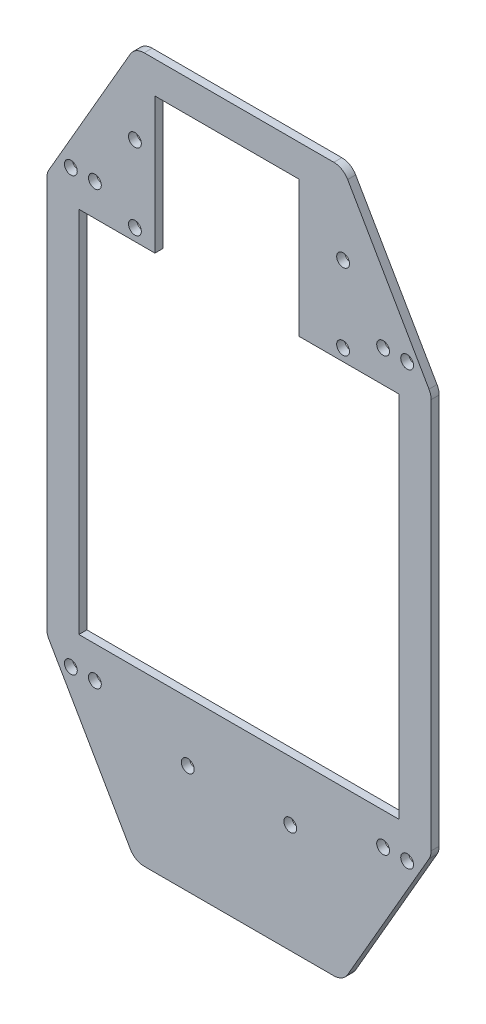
from build123d import *

# Parameters (mm, degrees)
EXTRUDE_1_DEPTH           = 30
EXTRUDE_2_DEPTH           = 40
MIRROR_2_COPY_1_DEPTH     = 40
EXTRUDE_START             = 20
SKETCH_3_W                = 200
SKETCH_3_H                = 230
EXTRUDE_3_DEPTH           = 20
EXTRUDE_START_2           = -10
EXTRUDE_11_DEPTH          = 15
FILLET_3_R                = 5
SKETCH_6_W                = 22
SKETCH_6_H                = 22
EXTRUDE_12_DEPTH          = 225
M8X1_0_1_AT_2_COUNT       = 2
M8X1_0_1_AT_2_PITCH       = 47.5
SKETCH_14_W               = 75
SKETCH_14_H               = 1
CUT_EXTRUDE_1_DEPTH       = 10
EXTRUDE_START_3           = -21
EXTRUDE_13_DEPTH          = 20
CUT_EXTRUDE_3_DEPTH       = 20
FILLET_4_R                = 5
EXTRUDE_14_REACH          = 388.297
EXTRUDE_START_4           = 5
SKETCH_20_W               = 200
SKETCH_20_H               = 230
EXTRUDE_15_DEPTH          = 5
SKETCH_24_W               = 75
SKETCH_24_H               = 85
EXTRUDE_16_DEPTH          = 30
HOLE_WIZARD_M8_1_D        = 6.8
HOLE_WIZARD_M8_1_DEPTH    = 20
HOLE_WIZARD_M8_1_TIP      = 2.042926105
EXTRUDE_START_5           = -12
EXTRUDE_17_DEPTH          = 5
PATTERN_LINEAR_2_COUNT    = 2
PATTERN_LINEAR_2_PITCH    = 26
HOLE_WIZARD_M8_2_D        = 6.8
HOLE_WIZARD_M8_2_DEPTH    = 22.5
HOLE_WIZARD_M8_2_TIP      = 2.042926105
SKETCH_32_W               = 15
SKETCH_32_H               = 85
CUT_EXTRUDE_7_DEPTH       = 30
SKETCH_33_W               = 90
SKETCH_33_H               = 85
CUT_EXTRUDE_8_DEPTH       = 12
SKETCH_34_W               = 100
SKETCH_34_H               = 59
CUT_EXTRUDE_9_DEPTH       = 9.25
SKETCH_35_W               = 350.252733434
SKETCH_35_H               = 581.551708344
CUT_EXTRUDE_10_DEPTH      = 21
CUT_EXTRUDE_START         = -5
SKETCH_53_W               = 746.993473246
SKETCH_53_H               = 735.961924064
CUT_EXTRUDE_26_DEPTH      = 110
SKETCH_54_OUTSIDE_W       = 605.222
SKETCH_54_OUTSIDE_H       = 775.222
CUT_EXTRUDE_27_DEPTH      = 110
SKETCH_57_R               = 4
CUT_EXTRUDE_28_DEPTH      = 10
SKETCH_59_R               = 4
CUT_EXTRUDE_29_DEPTH      = 10
MIRROR_11_COPY_1_SKETCH_R = 4
MIRROR_11_COPY_1_DEPTH    = 10


with BuildPart() as part:
    # Sketch 1 → Extrude 1 (new body)
    with BuildSketch(Plane.XY):
        with BuildLine():
            Line((-118.660254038, 127.025650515), (-67.868239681, 215))
            ThreePointArc((-67.868239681, 215), (-64.207985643, 218.660254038), (-59.207985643, 220))
            Line((-59.207985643, 220), (59.207985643, 220))
            ThreePointArc((59.207985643, 220), (64.207985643, 218.660254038), (67.868239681, 215))
            Line((67.868239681, 215), (118.660254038, 127.025650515))
            ThreePointArc((118.660254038, 127.025650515), (119.659258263, 124.613840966), (120, 122.025650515))
            Line((120, 122.025650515), (120, -122.025650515))
            ThreePointArc((120, -122.025650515), (119.659258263, -124.613840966), (118.660254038, -127.025650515))
            Line((118.660254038, -127.025650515), (67.868239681, -215))
            ThreePointArc((67.868239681, -215), (64.207985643, -218.660254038), (59.207985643, -220))
            Line((59.207985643, -220), (-59.207985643, -220))
            ThreePointArc((-59.207985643, -220), (-64.207985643, -218.660254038), (-67.868239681, -215))
            Line((-67.868239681, -215), (-118.660254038, -127.025650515))
            ThreePointArc((-118.660254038, -127.025650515), (-119.659258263, -124.613840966), (-120, -122.025650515))
            Line((-120, -122.025650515), (-120, 122.025650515))
            ThreePointArc((-120, 122.025650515), (-119.659258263, 124.613840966), (-118.660254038, 127.025650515))
        make_face()
        with BuildLine():
            Line((-98.660254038, 121.666666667), (-56.321234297, 195))
            ThreePointArc((-56.321234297, 195), (-52.660980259, 198.660254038), (-47.660980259, 200))
            Line((-47.660980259, 200), (47.660980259, 200))
            ThreePointArc((47.660980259, 200), (52.660980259, 198.660254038), (56.321234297, 195))
            Line((56.321234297, 195), (98.660254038, 121.666666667))
            ThreePointArc((98.660254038, 121.666666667), (99.659258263, 119.254857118), (100, 116.666666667))
            Line((100, 116.666666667), (100, -116.666666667))
            ThreePointArc((100, -116.666666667), (99.659258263, -119.254857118), (98.660254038, -121.666666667))
            Line((98.660254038, -121.666666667), (56.321234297, -195))
            ThreePointArc((56.321234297, -195), (52.660980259, -198.660254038), (47.660980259, -200))
            Line((47.660980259, -200), (-47.660980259, -200))
            ThreePointArc((-47.660980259, -200), (-52.660980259, -198.660254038), (-56.321234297, -195))
            Line((-56.321234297, -195), (-98.660254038, -121.666666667))
            ThreePointArc((-98.660254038, -121.666666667), (-99.659258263, -119.254857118), (-100, -116.666666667))
            Line((-100, -116.666666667), (-100, 116.666666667))
            ThreePointArc((-100, 116.666666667), (-99.659258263, 119.254857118), (-98.660254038, 121.666666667))
        make_face(mode=Mode.SUBTRACT)
    extrude(amount=EXTRUDE_1_DEPTH)

    # Sketch 2 → Extrude 2 (add)
    with BuildSketch(Plane.XY.offset(30)):
        Polygon((-100, 130), (-70, 130), (-70, 200), (-37.5, 200), (-37.5, 115), (-100, 115), align=None)
    extrude_2 = extrude(amount=-EXTRUDE_2_DEPTH)

    # Mirror 1: Extrude 2 across plane
    add(extrude_2.mirror(Plane.ZX))

    # Mirror 2: Extrude 2 across plane
    add(extrude_2.mirror(Plane(origin=(0, 0, 0), x_dir=(0, 0, 1), z_dir=(1, 0, 0))))

    # Mirror 2 copy 1 sketch → Mirror 2 copy 1 (add)
    with BuildSketch(Plane(origin=(0, 0, 30), x_dir=(-1, 0, 0), z_dir=(0, 0, 1))):
        Polygon((-100, 130), (-70, 130), (-70, 200), (-37.5, 200), (-37.5, 115), (-100, 115), align=None)
    extrude(amount=-MIRROR_2_COPY_1_DEPTH)

    # Sketch 3 → Extrude 3 (add)
    with BuildSketch(Plane(origin=(0, 0, 0), x_dir=(-1, 0, 0), z_dir=(0, 0, -1)).offset(EXTRUDE_START)):
        with BuildLine():
            Line((120, -122.025650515), (120, 122.025650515))
            ThreePointArc((120, 122.025650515), (119.659258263, 124.613840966), (118.660254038, 127.025650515))
            Line((118.660254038, 127.025650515), (67.868239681, 215))
            ThreePointArc((67.868239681, 215), (64.207985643, 218.660254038), (59.207985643, 220))
            Line((59.207985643, 220), (-59.207985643, 220))
            ThreePointArc((-59.207985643, 220), (-64.207985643, 218.660254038), (-67.868239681, 215))
            Line((-67.868239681, 215), (-118.660254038, 127.025650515))
            ThreePointArc((-118.660254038, 127.025650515), (-119.659258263, 124.613840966), (-120, 122.025650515))
            Line((-120, 122.025650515), (-120, -122.025650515))
            ThreePointArc((-120, -122.025650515), (-119.659258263, -124.613840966), (-118.660254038, -127.025650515))
            Line((-118.660254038, -127.025650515), (-67.868239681, -215))
            ThreePointArc((-67.868239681, -215), (-64.207985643, -218.660254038), (-59.207985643, -220))
            Line((-59.207985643, -220), (59.207985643, -220))
            ThreePointArc((59.207985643, -220), (64.207985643, -218.660254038), (67.868239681, -215))
            Line((67.868239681, -215), (118.660254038, -127.025650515))
            ThreePointArc((118.660254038, -127.025650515), (119.659258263, -124.613840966), (120, -122.025650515))
        make_face()
        Rectangle(SKETCH_3_W, SKETCH_3_H, mode=Mode.SUBTRACT)
    extrude(amount=-EXTRUDE_3_DEPTH)

    # Sketch 5 → Extrude 11 (add)
    with BuildSketch(Plane(origin=(0, 0, -20), x_dir=(-1, 0, 0), z_dir=(0, 0, -1)).offset(EXTRUDE_START_2)):
        with BuildLine():
            Line((-67.868239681, 215), (-67.868239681, 310))
            Line((-67.868239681, 310), (67.868239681, 310))
            Line((67.868239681, 310), (67.868239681, 215))
            ThreePointArc((67.868239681, 215), (64.207985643, 218.660254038), (59.207985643, 220))
            Line((59.207985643, 220), (-59.207985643, 220))
            ThreePointArc((-59.207985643, 220), (-64.207985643, 218.660254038), (-67.868239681, 215))
        make_face()
    extrude_11 = extrude(amount=-EXTRUDE_11_DEPTH)

    # Fillet 3
    fillet_3_edges = [part.edges().sort_by_distance(p)[0] for p in [
        (67.868239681, 310, -2.5),
        (-67.868239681, 310, -2.5),
    ]]
    fillet(fillet_3_edges, radius=FILLET_3_R)

    # Sketch 6 → Extrude 12 (add, symmetric)
    with BuildSketch(Plane(origin=(0, 0, 0), x_dir=(0, 0, -1), z_dir=(1, 0, 0))):
        with Locations((6, 210)):
            Rectangle(SKETCH_6_W, SKETCH_6_H)
    extrude_12 = extrude(amount=EXTRUDE_12_DEPTH, both=True)

    # Sketch 11 → M8x1.0 _1 (revolve, cut)
    with BuildSketch(Plane(origin=(-65, 122.5, 30), x_dir=(0, -1, 0), z_dir=(1, 0, 0))):
        Polygon((0, 0), (0, 23.103012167), (3.5, 21), (3.5, 0), align=None)
    m8x1_0_1 = revolve(axis=Axis((-65, 122.5, 36.35), (0, 0, -1)), mode=Mode.SUBTRACT)

    # M8x1.0 _1 at 2: M8x1.0 _1 ×2
    with Locations(*[(0, i * M8X1_0_1_AT_2_PITCH, 0) for i in range(1, M8X1_0_1_AT_2_COUNT)]):
        add(m8x1_0_1, mode=Mode.SUBTRACT)

    # Mirror 7: M8x1.0 _1 across plane
    add(m8x1_0_1.mirror(Plane(origin=(0, 0, 0), x_dir=(0, 0, 1), z_dir=(1, 0, 0))), mode=Mode.SUBTRACT)

    # Mirror 7 copy 1 sketch → Mirror 7 copy 1 (revolve, cut)
    with BuildSketch(Plane(origin=(65, 170, 30), x_dir=(0, -1, 0), z_dir=(-1, 0, 0))):
        Polygon((0, 0), (0, -23.103012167), (3.5, -21), (3.5, 0), align=None)
    revolve(axis=Axis((65, 170, 36.35), (0, 0, 1)), mode=Mode.SUBTRACT)

    # Sketch 14 → Cut-Extrude 1 (cut)
    with BuildSketch(Plane.XY):
        with Locations((0, 199.5)):
            Rectangle(SKETCH_14_W, SKETCH_14_H)
    cut_extrude_1 = extrude(amount=CUT_EXTRUDE_1_DEPTH, mode=Mode.SUBTRACT)

    # Mirror 8: Extrude 11, Extrude 12, Cut-Extrude 1 across plane
    add(extrude_11.mirror(Plane.ZX))
    add(extrude_12.mirror(Plane.ZX))
    add(cut_extrude_1.mirror(Plane.ZX), mode=Mode.SUBTRACT)

    # Sketch 16 → Extrude 13 (add)
    with BuildSketch(Plane.XY.offset(5).offset(EXTRUDE_START_3)):
        with BuildLine():
            Line((135, 199), (135, -199))
            Line((135, -199), (77.105843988, -199))
            Line((77.105843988, -199), (118.660254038, -127.025650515))
            ThreePointArc((118.660254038, -127.025650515), (119.659258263, -124.613840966), (120, -122.025650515))
            Line((120, -122.025650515), (120, 122.025650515))
            ThreePointArc((120, 122.025650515), (119.659258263, 124.613840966), (118.660254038, 127.025650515))
            Line((118.660254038, 127.025650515), (77.105843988, 199))
            Line((77.105843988, 199), (135, 199))
        make_face()
        with BuildLine():
            Line((-135, 199), (-77.105843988, 199))
            Line((-77.105843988, 199), (-118.660254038, 127.025650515))
            ThreePointArc((-118.660254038, 127.025650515), (-119.659258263, 124.613840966), (-120, 122.025650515))
            Line((-120, 122.025650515), (-120, -122.025650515))
            ThreePointArc((-120, -122.025650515), (-119.659258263, -124.613840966), (-118.660254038, -127.025650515))
            Line((-118.660254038, -127.025650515), (-77.105843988, -199))
            Line((-77.105843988, -199), (-135, -199))
            Line((-135, -199), (-135, 199))
        make_face()
    extrude(amount=EXTRUDE_13_DEPTH)

    # Sketch 17 → Cut-Extrude 3 (cut)
    with BuildSketch(Plane.XY.offset(4)):
        Polygon((105.973357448, 199), (135, 148.724380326), (135, 199), align=None)
        Polygon((135, -199), (105.973357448, -199), (135, -148.724380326), align=None)
        Polygon((-105.973357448, -199), (-135, -148.724380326), (-135, -199), align=None)
        Polygon((-135, 199), (-105.973357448, 199), (-135, 148.724380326), align=None)
    extrude(amount=-CUT_EXTRUDE_3_DEPTH, mode=Mode.SUBTRACT)

    # Fillet 4
    fillet_4_edges = [part.edges().sort_by_distance(p)[0] for p in [
        (-135, 148.724380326, -6),
        (-105.973357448, 199, -6),
        (-105.973357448, -199, -6),
        (-135, -148.724380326, -6),
        (135, -148.724380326, -6),
        (105.973357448, -199, -6),
        (105.973357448, 199, -6),
        (135, 148.724380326, -6),
    ]]
    fillet(fillet_4_edges, radius=FILLET_4_R)

    # Sketch 19 → Extrude 14 (add, up to next)
    with BuildSketch(Plane.XY.offset(30), mode=Mode.PRIVATE) as extrude_14_sk1:
        Polygon((-93.849001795, 130), (-70, 130), (-70, 171.307682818), align=None)
    extrude_14_tool1 = extrude(extrude_14_sk1.sketch, amount=-EXTRUDE_14_REACH, mode=Mode.PRIVATE) - part.part
    # Sketch 19 → Extrude 14 (add, up to next)
    with BuildSketch(Plane.XY.offset(30), mode=Mode.PRIVATE) as extrude_14_sk2:
        Polygon((93.849001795, 130), (70, 171.307682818), (70, 130), align=None)
    extrude_14_tool2 = extrude(extrude_14_sk2.sketch, amount=-EXTRUDE_14_REACH, mode=Mode.PRIVATE) - part.part
    # Sketch 19 → Extrude 14 (add, up to next)
    with BuildSketch(Plane.XY.offset(30), mode=Mode.PRIVATE) as extrude_14_sk3:
        Polygon((93.849001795, -130), (70, -130), (70, -171.307682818), align=None)
    extrude_14_tool3 = extrude(extrude_14_sk3.sketch, amount=-EXTRUDE_14_REACH, mode=Mode.PRIVATE) - part.part
    # Sketch 19 → Extrude 14 (add, up to next)
    with BuildSketch(Plane.XY.offset(30), mode=Mode.PRIVATE) as extrude_14_sk4:
        Polygon((-93.849001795, -130), (-70, -171.307682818), (-70, -130), align=None)
    extrude_14_tool4 = extrude(extrude_14_sk4.sketch, amount=-EXTRUDE_14_REACH, mode=Mode.PRIVATE) - part.part
    add(extrude_14_tool1.solids().sort_by_distance((-77.949667, 143.769228, 30))[0])
    add(extrude_14_tool2.solids().sort_by_distance((77.949667, 143.769228, 30))[0])
    add(extrude_14_tool3.solids().sort_by_distance((77.949667, -143.769228, 30))[0])
    add(extrude_14_tool4.solids().sort_by_distance((-77.949667, -143.769228, 30))[0])

    # Sketch 20 → Extrude 15 (add)
    with BuildSketch(Plane(origin=(0, 0, -20), x_dir=(-1, 0, 0), z_dir=(0, 0, -1)).offset(EXTRUDE_START_4)):
        with BuildLine():
            Line((120, -122.025650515), (120, 122.025650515))
            ThreePointArc((120, 122.025650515), (119.659258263, 124.613840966), (118.660254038, 127.025650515))
            Line((118.660254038, 127.025650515), (67.868239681, 215))
            ThreePointArc((67.868239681, 215), (64.207985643, 218.660254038), (59.207985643, 220))
            Line((59.207985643, 220), (-59.207985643, 220))
            ThreePointArc((-59.207985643, 220), (-64.207985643, 218.660254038), (-67.868239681, 215))
            Line((-67.868239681, 215), (-118.660254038, 127.025650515))
            ThreePointArc((-118.660254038, 127.025650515), (-119.659258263, 124.613840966), (-120, 122.025650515))
            Line((-120, 122.025650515), (-120, -122.025650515))
            ThreePointArc((-120, -122.025650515), (-119.659258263, -124.613840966), (-118.660254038, -127.025650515))
            Line((-118.660254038, -127.025650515), (-67.868239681, -215))
            ThreePointArc((-67.868239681, -215), (-64.207985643, -218.660254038), (-59.207985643, -220))
            Line((-59.207985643, -220), (59.207985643, -220))
            ThreePointArc((59.207985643, -220), (64.207985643, -218.660254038), (67.868239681, -215))
            Line((67.868239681, -215), (118.660254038, -127.025650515))
            ThreePointArc((118.660254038, -127.025650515), (119.659258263, -124.613840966), (120, -122.025650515))
        make_face()
        Rectangle(SKETCH_20_W, SKETCH_20_H, mode=Mode.SUBTRACT)
    extrude(amount=-EXTRUDE_15_DEPTH)

    # Sketch 24 → Extrude 16 (add)
    with BuildSketch(Plane.XY):
        with Locations((0, -157.5)):
            Rectangle(SKETCH_24_W, SKETCH_24_H)
    extrude(amount=EXTRUDE_16_DEPTH)

    # Hole Wizard M8 _1
    with Locations(Plane(origin=(0, -115, -22), x_dir=(0, 0, 1), z_dir=(0, 1, 0))):
        with Locations((0, 0)):
            Hole(HOLE_WIZARD_M8_1_D / 2, depth=HOLE_WIZARD_M8_1_DEPTH)
            with Locations((0, 0, -(HOLE_WIZARD_M8_1_DEPTH + HOLE_WIZARD_M8_1_TIP / 2))):  # 118° drill point
                Cone(0, HOLE_WIZARD_M8_1_D / 2, HOLE_WIZARD_M8_1_TIP, mode=Mode.SUBTRACT)

    # Sketch 27 → Extrude 17 (add)
    with BuildSketch(Plane.XY.offset(30).offset(EXTRUDE_START_5)):
        Polygon((-16, -115), (-16, -105), (16, -105), (16, -115), (12, -115), (12, -111), (-12, -111), (-12, -115), align=None)
    extrude_17 = extrude(amount=-EXTRUDE_17_DEPTH)

    # Pattern Linear 2: Extrude 17 ×2
    with Locations(*[(0, 0, -i * PATTERN_LINEAR_2_PITCH) for i in range(1, PATTERN_LINEAR_2_COUNT)]):
        add(extrude_17)

    # Hole Wizard M8 _2
    with Locations(Plane(origin=(-32, -152, 30), x_dir=(1, 0, 0), z_dir=(0, 0, 1))):
        with Locations((0, 0), (64, 0)):
            Hole(HOLE_WIZARD_M8_2_D / 2, depth=HOLE_WIZARD_M8_2_DEPTH)
            with Locations((0, 0, -(HOLE_WIZARD_M8_2_DEPTH + HOLE_WIZARD_M8_2_TIP / 2))):  # 118° drill point
                Cone(0, HOLE_WIZARD_M8_2_D / 2, HOLE_WIZARD_M8_2_TIP, mode=Mode.SUBTRACT)

    # Sketch 32 → Cut-Extrude 7 (cut)
    with BuildSketch(Plane.XY.offset(30)):
        with Locations((-45, 157.5)):
            Rectangle(SKETCH_32_W, SKETCH_32_H)
    extrude(amount=-CUT_EXTRUDE_7_DEPTH, mode=Mode.SUBTRACT)

    # Sketch 33 → Cut-Extrude 8 (cut)
    with BuildSketch(Plane.XY):
        with Locations((-7.5, 157.5)):
            Rectangle(SKETCH_33_W, SKETCH_33_H)
    extrude(amount=-CUT_EXTRUDE_8_DEPTH, mode=Mode.SUBTRACT)

    # Sketch 34 → Cut-Extrude 9 (cut)
    with BuildSketch(Plane.XY.offset(30)):
        with Locations((0, -144.5)):
            Rectangle(SKETCH_34_W, SKETCH_34_H)
    extrude(amount=-CUT_EXTRUDE_9_DEPTH, mode=Mode.SUBTRACT)

    # Sketch 35 → Cut-Extrude 10 (cut)
    with BuildSketch(Plane.XY.offset(30)):
        Rectangle(SKETCH_35_W, SKETCH_35_H)
    extrude(amount=-CUT_EXTRUDE_10_DEPTH, mode=Mode.SUBTRACT)

    # Sketch 53 → Cut-Extrude 26 (cut)
    with BuildSketch(Plane.XY.offset(9).offset(CUT_EXTRUDE_START)):
        Rectangle(SKETCH_53_W, SKETCH_53_H)
    extrude(amount=-CUT_EXTRUDE_26_DEPTH, mode=Mode.SUBTRACT)

    # Sketch 54 outside → Cut-Extrude 27 (cut)
    with BuildSketch(Plane.XY.offset(9)):
        Rectangle(SKETCH_54_OUTSIDE_W, SKETCH_54_OUTSIDE_H)
        with BuildLine():
            Line((59.207985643, 220), (-59.207985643, 220))
            ThreePointArc((-59.207985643, 220), (-64.207985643, 218.660254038), (-67.868239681, 215))
            Line((-67.868239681, 215), (-118.660254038, 127.025650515))
            ThreePointArc((-118.660254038, 127.025650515), (-119.659258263, 124.613840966), (-120, 122.025650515))
            Line((-120, 122.025650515), (-120, -122.025650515))
            ThreePointArc((-120, -122.025650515), (-119.659258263, -124.613840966), (-118.660254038, -127.025650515))
            Line((-118.660254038, -127.025650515), (-67.868239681, -215))
            ThreePointArc((-67.868239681, -215), (-64.207985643, -218.660254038), (-59.207985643, -220))
            Line((-59.207985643, -220), (59.207985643, -220))
            ThreePointArc((59.207985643, -220), (64.207985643, -218.660254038), (67.868239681, -215))
            Line((67.868239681, -215), (118.660254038, -127.025650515))
            ThreePointArc((118.660254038, -127.025650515), (119.659258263, -124.613840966), (120, -122.025650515))
            Line((120, -122.025650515), (120, 122.025650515))
            ThreePointArc((120, 122.025650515), (119.659258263, 124.613840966), (118.660254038, 127.025650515))
            Line((118.660254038, 127.025650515), (67.868239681, 215))
            ThreePointArc((67.868239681, 215), (64.207985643, 218.660254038), (59.207985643, 220))
        make_face(mode=Mode.SUBTRACT)
    extrude(amount=-CUT_EXTRUDE_27_DEPTH, mode=Mode.SUBTRACT)

    # Sketch 57 → Cut-Extrude 28 (cut)
    with BuildSketch(Plane.XY.offset(9)):
        with Locations((65, 122.5)):
            Circle(SKETCH_57_R)
        with Locations((65, 170)):
            Circle(SKETCH_57_R)
        with Locations((32, -152)):
            Circle(SKETCH_57_R)
    cut_extrude_28 = extrude(amount=-CUT_EXTRUDE_28_DEPTH, mode=Mode.SUBTRACT)

    # Mirror 9: Cut-Extrude 28 across plane
    add(cut_extrude_28.mirror(Plane(origin=(0, 0, 0), x_dir=(0, 0, 1), z_dir=(1, 0, 0))), mode=Mode.SUBTRACT)

    # Sketch 59 → Cut-Extrude 29 (cut)
    with BuildSketch(Plane.XY.offset(9)):
        with Locations((-105, -135)):
            Circle(SKETCH_59_R)
        with Locations((-90, -135)):
            Circle(SKETCH_59_R)
    cut_extrude_29 = extrude(amount=-CUT_EXTRUDE_29_DEPTH, mode=Mode.SUBTRACT)

    # Mirror 10: Cut-Extrude 29 across plane
    add(cut_extrude_29.mirror(Plane(origin=(0, 0, 0), x_dir=(0, 0, 1), z_dir=(1, 0, 0))), mode=Mode.SUBTRACT)

    # Mirror 11: Cut-Extrude 29 across plane
    add(cut_extrude_29.mirror(Plane.ZX), mode=Mode.SUBTRACT)

    # Mirror 11 copy 1 sketch → Mirror 11 copy 1 (cut)
    with BuildSketch(Plane(origin=(0, 0, 9), x_dir=(-1, 0, 0), z_dir=(0, 0, 1))):
        with Locations((-105, -135)):
            Circle(MIRROR_11_COPY_1_SKETCH_R)
        with Locations((-90, -135)):
            Circle(MIRROR_11_COPY_1_SKETCH_R)
    extrude(amount=-MIRROR_11_COPY_1_DEPTH, mode=Mode.SUBTRACT)


solid = part.part
